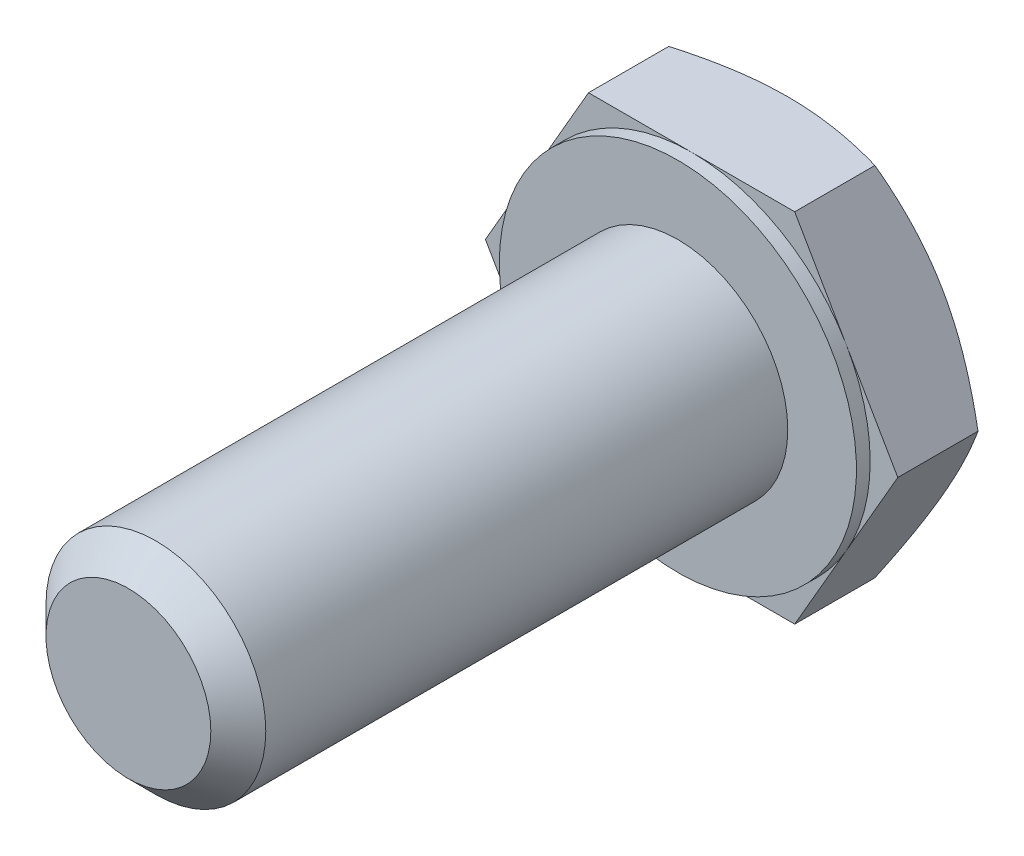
ISO-10303-21;
HEADER;
FILE_DESCRIPTION(('STEP AP214'),'2;1');
FILE_NAME('part.step','',(''),(''),'','','');
FILE_SCHEMA(('AUTOMOTIVE_DESIGN { 1 0 10303 214 1 1 1 1 }'));
ENDSEC;
DATA;
#1=APPLICATION_CONTEXT('core data for automotive mechanical design processes');
#2=APPLICATION_PROTOCOL_DEFINITION('international standard','automotive_design',2000,#1);
#3=PRODUCT_CONTEXT('',#1,'mechanical');
#4=PRODUCT('Part','Part','',(#3));
#5=PRODUCT_RELATED_PRODUCT_CATEGORY('part','',(#4));
#6=PRODUCT_DEFINITION_FORMATION('','',#4);
#7=PRODUCT_DEFINITION_CONTEXT('part definition',#1,'design');
#8=PRODUCT_DEFINITION('design','',#6,#7);
#9=PRODUCT_DEFINITION_SHAPE('','',#8);
#10=(LENGTH_UNIT() NAMED_UNIT(*) SI_UNIT(.MILLI.,.METRE.));
#11=(NAMED_UNIT(*) PLANE_ANGLE_UNIT() SI_UNIT($,.RADIAN.));
#12=(NAMED_UNIT(*) SI_UNIT($,.STERADIAN.) SOLID_ANGLE_UNIT());
#13=UNCERTAINTY_MEASURE_WITH_UNIT(LENGTH_MEASURE(1.E-05),#10,'distance_accuracy_value','');
#14=(GEOMETRIC_REPRESENTATION_CONTEXT(3) GLOBAL_UNCERTAINTY_ASSIGNED_CONTEXT((#13)) GLOBAL_UNIT_ASSIGNED_CONTEXT((#10,
#11,#12)) REPRESENTATION_CONTEXT('',''));
#15=CARTESIAN_POINT('',(0.,0.,0.));
#16=DIRECTION('',(0.,0.,1.));
#17=DIRECTION('',(1.,0.,0.));
#18=AXIS2_PLACEMENT_3D('',#15,#16,#17);
#19=CARTESIAN_POINT('',(0.,0.,-4.));
#20=DIRECTION('',(0.,0.,-1.));
#21=DIRECTION('',(-1.,0.,0.));
#22=AXIS2_PLACEMENT_3D('',#19,#20,#21);
#23=PLANE('',#22);
#24=CARTESIAN_POINT('',(0.,0.,-4.00000000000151));
#25=DIRECTION('',(0.,0.,1.));
#26=DIRECTION('',(0.,-1.,0.));
#27=AXIS2_PLACEMENT_3D('',#24,#25,#26);
#28=CIRCLE('',#27,6.49999999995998);
#29=CARTESIAN_POINT('',(-5.6291651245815,3.24999999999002,-3.99999999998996));
#30=VERTEX_POINT('',#29);
#31=CARTESIAN_POINT('',(-5.62916512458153,-3.24999999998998,-3.99999999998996));
#32=VERTEX_POINT('',#31);
#33=EDGE_CURVE('E94',#30,#32,#28,.T.);
#34=ORIENTED_EDGE('',*,*,#33,.F.);
#35=CARTESIAN_POINT('',(0.,0.,-4.00000000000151));
#36=DIRECTION('',(0.,0.,1.));
#37=DIRECTION('',(0.,-1.,0.));
#38=AXIS2_PLACEMENT_3D('',#35,#36,#37);
#39=CIRCLE('',#38,6.49999999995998);
#40=CARTESIAN_POINT('',(0.,6.49999999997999,-3.99999999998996));
#41=VERTEX_POINT('',#40);
#42=EDGE_CURVE('E127',#41,#30,#39,.T.);
#43=ORIENTED_EDGE('',*,*,#42,.F.);
#44=CARTESIAN_POINT('',(0.,0.,-4.00000000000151));
#45=DIRECTION('',(0.,0.,1.));
#46=DIRECTION('',(0.,-1.,0.));
#47=AXIS2_PLACEMENT_3D('',#44,#45,#46);
#48=CIRCLE('',#47,6.49999999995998);
#49=CARTESIAN_POINT('',(5.62916512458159,3.24999999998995,-3.99999999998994));
#50=VERTEX_POINT('',#49);
#51=EDGE_CURVE('E111',#50,#41,#48,.T.);
#52=ORIENTED_EDGE('',*,*,#51,.F.);
#53=CARTESIAN_POINT('',(0.,0.,-4.00000000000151));
#54=DIRECTION('',(0.,0.,1.));
#55=DIRECTION('',(0.,-1.,0.));
#56=AXIS2_PLACEMENT_3D('',#53,#54,#55);
#57=CIRCLE('',#56,6.49999999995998);
#58=CARTESIAN_POINT('',(5.62916512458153,-3.24999999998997,-3.99999999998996));
#59=VERTEX_POINT('',#58);
#60=EDGE_CURVE('E112',#59,#50,#57,.T.);
#61=ORIENTED_EDGE('',*,*,#60,.F.);
#62=CARTESIAN_POINT('',(0.,0.,-4.00000000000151));
#63=DIRECTION('',(0.,0.,1.));
#64=DIRECTION('',(0.,-1.,0.));
#65=AXIS2_PLACEMENT_3D('',#62,#63,#64);
#66=CIRCLE('',#65,6.49999999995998);
#67=CARTESIAN_POINT('',(0.,-6.49999999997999,-3.99999999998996));
#68=VERTEX_POINT('',#67);
#69=EDGE_CURVE('E97',#68,#59,#66,.T.);
#70=ORIENTED_EDGE('',*,*,#69,.F.);
#71=CARTESIAN_POINT('',(0.,0.,-4.00000000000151));
#72=DIRECTION('',(0.,0.,1.));
#73=DIRECTION('',(0.,-1.,0.));
#74=AXIS2_PLACEMENT_3D('',#71,#72,#73);
#75=CIRCLE('',#74,6.49999999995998);
#76=EDGE_CURVE('E19',#32,#68,#75,.T.);
#77=ORIENTED_EDGE('',*,*,#76,.F.);
#78=EDGE_LOOP('',(#34,#43,#52,#61,#70,#77));
#79=FACE_BOUND('',#78,.T.);
#80=ADVANCED_FACE('F16',(#79),#23,.T.);
#81=CARTESIAN_POINT('',(0.,0.,-3.41596007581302));
#82=DIRECTION('',(0.,0.,1.));
#83=DIRECTION('',(0.,-1.,0.));
#84=AXIS2_PLACEMENT_3D('',#81,#82,#83);
#85=CONICAL_SURFACE('',#84,7.51158681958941,1.04719755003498);
#86=CARTESIAN_POINT('',(-5.62916512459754,-3.24999999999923,-3.99999999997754));
#87=CARTESIAN_POINT('',(-5.54952296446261,-3.3879442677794,-4.000026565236));
#88=CARTESIAN_POINT('',(-5.46988464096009,-3.52588189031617,-3.99662027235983));
#89=CARTESIAN_POINT('',(-5.31076436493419,-3.80148629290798,-3.98313941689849));
#90=CARTESIAN_POINT('',(-5.23128238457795,-3.93915312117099,-3.97306617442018));
#91=CARTESIAN_POINT('',(-5.07298818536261,-4.21332671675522,-3.94651519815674));
#92=CARTESIAN_POINT('',(-4.99417460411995,-4.34983584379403,-3.93006970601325));
#93=CARTESIAN_POINT('',(-4.83692293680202,-4.62220372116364,-3.89112797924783));
#94=CARTESIAN_POINT('',(-4.75848486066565,-4.75806245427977,-3.86863158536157));
#95=CARTESIAN_POINT('',(-4.52405902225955,-5.16409991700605,-3.79276102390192));
#96=CARTESIAN_POINT('',(-4.36875227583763,-5.43309909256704,-3.73096863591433));
#97=CARTESIAN_POINT('',(-4.05947435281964,-5.9687841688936,-3.58845958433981));
#98=CARTESIAN_POINT('',(-3.90551396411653,-6.23545138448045,-3.50764840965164));
#99=CARTESIAN_POINT('',(-3.75277674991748,-6.49999999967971,-3.41944341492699));
#100=B_SPLINE_CURVE_WITH_KNOTS('',3,(#86,#87,#88,#89,#90,#91,#92,#93,#94,#95,#96,#97,#98,#99),
.UNSPECIFIED.,.F.,.F.,(4,2,2,2,2,2,4),(0.,0.477804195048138,0.955513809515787,1.43083727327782,
1.90617324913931,2.85559935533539,3.80984701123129),.UNSPECIFIED.);
#101=CARTESIAN_POINT('',(-3.75277674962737,-6.49999999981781,-3.41944341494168));
#102=VERTEX_POINT('',#101);
#103=EDGE_CURVE('E114',#32,#102,#100,.T.);
#104=ORIENTED_EDGE('',*,*,#103,.F.);
#105=ORIENTED_EDGE('',*,*,#76,.T.);
#106=CARTESIAN_POINT('',(-3.75277674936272,-6.50000000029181,-3.41944341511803));
#107=CARTESIAN_POINT('',(-3.44730232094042,-6.50000000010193,-3.50764840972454));
#108=CARTESIAN_POINT('',(-3.13938154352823,-6.50000000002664,-3.58845958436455));
#109=CARTESIAN_POINT('',(-2.52082569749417,-6.49999999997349,-3.73096863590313));
#110=CARTESIAN_POINT('',(-2.2102122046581,-6.49999999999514,-3.79276102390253));
#111=CARTESIAN_POINT('',(-1.74136052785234,-6.50000000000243,-3.86863158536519));
#112=CARTESIAN_POINT('',(-1.58448437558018,-6.50000000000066,-3.89112797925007));
#113=CARTESIAN_POINT('',(-1.26998104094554,-6.49999999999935,-3.93006970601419));
#114=CARTESIAN_POINT('',(-1.11235387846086,-6.49999999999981,-3.94651519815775));
#115=CARTESIAN_POINT('',(-0.795765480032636,-6.50000000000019,-3.97306617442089));
#116=CARTESIAN_POINT('',(-0.636801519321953,-6.5000000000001,-3.98313941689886));
#117=CARTESIAN_POINT('',(-0.318560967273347,-6.49999999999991,-3.99662027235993));
#118=CARTESIAN_POINT('',(-0.159284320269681,-6.49999999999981,-4.00002656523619));
#119=CARTESIAN_POINT('',(-2.49784673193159E-13,-6.5,-3.99999999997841));
#120=B_SPLINE_CURVE_WITH_KNOTS('',3,(#106,#107,#108,#109,#110,#111,#112,#113,#114,#115,#116,
#117,#118,#119),.UNSPECIFIED.,.F.,.F.,(4,2,2,2,2,2,4),(0.,0.954247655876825,1.90367376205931,
2.37900973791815,2.85433320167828,3.33204281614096,3.80984701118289),.UNSPECIFIED.);
#121=EDGE_CURVE('E117',#102,#68,#120,.T.);
#122=ORIENTED_EDGE('',*,*,#121,.F.);
#123=EDGE_LOOP('',(#104,#105,#122));
#124=FACE_BOUND('',#123,.T.);
#125=ADVANCED_FACE('F115',(#124),#85,.T.);
#126=CARTESIAN_POINT('',(0.,0.,-3.41596007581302));
#127=DIRECTION('',(0.,0.,1.));
#128=DIRECTION('',(0.,-1.,0.));
#129=AXIS2_PLACEMENT_3D('',#126,#127,#128);
#130=CONICAL_SURFACE('',#129,7.51158681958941,1.04719755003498);
#131=CARTESIAN_POINT('',(0.,-6.4999999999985,-3.99999999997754));
#132=CARTESIAN_POINT('',(0.159284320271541,-6.49999999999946,-4.000026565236));
#133=CARTESIAN_POINT('',(0.318560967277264,-6.49999999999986,-3.99662027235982));
#134=CARTESIAN_POINT('',(0.636801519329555,-6.50000000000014,-3.98313941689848));
#135=CARTESIAN_POINT('',(0.795765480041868,-6.50000000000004,-3.97306617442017));
#136=CARTESIAN_POINT('',(1.1123538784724,-6.49999999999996,-3.94651519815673));
#137=CARTESIAN_POINT('',(1.26998104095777,-6.49999999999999,-3.93006970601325));
#138=CARTESIAN_POINT('',(1.58448437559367,-6.50000000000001,-3.89112797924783));
#139=CARTESIAN_POINT('',(1.74136052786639,-6.5,-3.86863158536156));
#140=CARTESIAN_POINT('',(2.21021220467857,-6.49999999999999,-3.79276102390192));
#141=CARTESIAN_POINT('',(2.52082569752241,-6.5,-3.73096863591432));
#142=CARTESIAN_POINT('',(3.1393815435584,-6.5,-3.58845958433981));
#143=CARTESIAN_POINT('',(3.44730232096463,-6.50000000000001,-3.50764840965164));
#144=CARTESIAN_POINT('',(3.75277674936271,-6.5,-3.41944341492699));
#145=B_SPLINE_CURVE_WITH_KNOTS('',3,(#131,#132,#133,#134,#135,#136,#137,#138,#139,#140,#141,
#142,#143,#144),.UNSPECIFIED.,.F.,.F.,(4,2,2,2,2,2,4),(0.,0.477804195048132,0.955513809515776,
1.4308372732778,1.90617324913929,2.85559935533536,3.80984701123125),.UNSPECIFIED.);
#146=CARTESIAN_POINT('',(3.75277674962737,-6.49999999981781,-3.41944341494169));
#147=VERTEX_POINT('',#146);
#148=EDGE_CURVE('E212',#68,#147,#145,.T.);
#149=ORIENTED_EDGE('',*,*,#148,.F.);
#150=ORIENTED_EDGE('',*,*,#69,.T.);
#151=CARTESIAN_POINT('',(3.7527767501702,-6.49999999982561,-3.41944341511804));
#152=CARTESIAN_POINT('',(3.90551396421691,-6.23545138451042,-3.50764840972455));
#153=CARTESIAN_POINT('',(4.0594743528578,-5.96878416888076,-3.58845958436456));
#154=CARTESIAN_POINT('',(4.36875227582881,-5.43309909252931,-3.73096863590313));
#155=CARTESIAN_POINT('',(4.52405902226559,-5.16409991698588,-3.79276102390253));
#156=CARTESIAN_POINT('',(4.75848486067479,-4.7580624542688,-3.8686315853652));
#157=CARTESIAN_POINT('',(4.83692293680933,-4.62220372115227,-3.89112797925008));
#158=CARTESIAN_POINT('',(4.99417460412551,-4.3498358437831,-3.9300697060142));
#159=CARTESIAN_POINT('',(5.07298818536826,-4.21332671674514,-3.94651519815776));
#160=CARTESIAN_POINT('',(5.2312823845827,-3.93915312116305,-3.9730661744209));
#161=CARTESIAN_POINT('',(5.31076436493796,-3.80148629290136,-3.98313941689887));
#162=CARTESIAN_POINT('',(5.4698846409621,-3.52588189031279,-3.99662027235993));
#163=CARTESIAN_POINT('',(5.54952296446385,-3.38794426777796,-4.00002656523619));
#164=CARTESIAN_POINT('',(5.62916512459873,-3.25000000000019,-3.99999999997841));
#165=B_SPLINE_CURVE_WITH_KNOTS('',3,(#151,#152,#153,#154,#155,#156,#157,#158,#159,#160,#161,
#162,#163,#164),.UNSPECIFIED.,.F.,.F.,(4,2,2,2,2,2,4),(0.,0.95424765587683,1.90367376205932,
2.37900973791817,2.8543332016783,3.33204281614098,3.80984701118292),.UNSPECIFIED.);
#166=EDGE_CURVE('E205',#147,#59,#165,.T.);
#167=ORIENTED_EDGE('',*,*,#166,.F.);
#168=EDGE_LOOP('',(#149,#150,#167));
#169=FACE_BOUND('',#168,.T.);
#170=ADVANCED_FACE('F216',(#169),#130,.T.);
#171=CARTESIAN_POINT('',(0.,0.,-3.41596007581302));
#172=DIRECTION('',(0.,0.,1.));
#173=DIRECTION('',(0.,-1.,0.));
#174=AXIS2_PLACEMENT_3D('',#171,#172,#173);
#175=CONICAL_SURFACE('',#174,7.51158681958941,1.04719755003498);
#176=ORIENTED_EDGE('',*,*,#60,.T.);
#177=CARTESIAN_POINT('',(7.50555349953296,4.66246568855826E-10,-3.41944341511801));
#178=CARTESIAN_POINT('',(7.35281628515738,0.264548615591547,-3.50764840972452));
#179=CARTESIAN_POINT('',(7.19885589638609,0.531215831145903,-3.58845958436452));
#180=CARTESIAN_POINT('',(6.88957797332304,1.0669009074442,-3.73096863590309));
#181=CARTESIAN_POINT('',(6.73427122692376,1.33590008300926,-3.79276102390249));
#182=CARTESIAN_POINT('',(6.4998453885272,1.74193754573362,-3.86863158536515));
#183=CARTESIAN_POINT('',(6.42140731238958,1.87779627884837,-3.89112797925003));
#184=CARTESIAN_POINT('',(6.26415564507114,2.15016415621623,-3.93006970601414));
#185=CARTESIAN_POINT('',(6.1853420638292,2.28667328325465,-3.94651519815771));
#186=CARTESIAN_POINT('',(6.02704786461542,2.5608468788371,-3.97306617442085));
#187=CARTESIAN_POINT('',(5.94756588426,2.6985137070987,-3.98313941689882));
#188=CARTESIAN_POINT('',(5.78844560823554,2.97411810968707,-3.99662027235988));
#189=CARTESIAN_POINT('',(5.70880728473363,3.1120557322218,-4.00002656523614));
#190=CARTESIAN_POINT('',(5.62916512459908,3.24999999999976,-3.99999999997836));
#191=B_SPLINE_CURVE_WITH_KNOTS('',3,(#177,#178,#179,#180,#181,#182,#183,#184,#185,#186,#187,
#188,#189,#190),.UNSPECIFIED.,.F.,.F.,(4,2,2,2,2,2,4),(0.,0.954247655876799,1.90367376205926,
2.37900973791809,2.85433320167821,3.33204281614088,3.8098470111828),.UNSPECIFIED.);
#192=CARTESIAN_POINT('',(7.50555349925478,0.,-3.41944341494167));
#193=VERTEX_POINT('',#192);
#194=EDGE_CURVE('E193',#193,#50,#191,.T.);
#195=ORIENTED_EDGE('',*,*,#194,.F.);
#196=CARTESIAN_POINT('',(5.62916512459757,-3.24999999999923,-3.99999999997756));
#197=CARTESIAN_POINT('',(5.70880728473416,-3.11205573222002,-4.00002656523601));
#198=CARTESIAN_POINT('',(5.78844560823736,-2.97411810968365,-3.99662027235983));
#199=CARTESIAN_POINT('',(5.94756588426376,-2.69851370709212,-3.98313941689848));
#200=CARTESIAN_POINT('',(6.02704786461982,-2.56084687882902,-3.97306617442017));
#201=CARTESIAN_POINT('',(6.18534206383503,-2.2866732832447,-3.94651519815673));
#202=CARTESIAN_POINT('',(6.26415564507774,-2.15016415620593,-3.93006970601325));
#203=CARTESIAN_POINT('',(6.4214073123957,-1.87779627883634,-3.89112797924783));
#204=CARTESIAN_POINT('',(6.49984538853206,-1.7419375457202,-3.86863158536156));
#205=CARTESIAN_POINT('',(6.73427122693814,-1.33590008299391,-3.79276102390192));
#206=CARTESIAN_POINT('',(6.88957797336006,-1.06690090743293,-3.73096863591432));
#207=CARTESIAN_POINT('',(7.19885589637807,-0.531215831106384,-3.5884595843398));
#208=CARTESIAN_POINT('',(7.35281628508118,-0.264548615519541,-3.50764840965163));
#209=CARTESIAN_POINT('',(7.50555349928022,-3.20270050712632E-10,-3.41944341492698));
#210=B_SPLINE_CURVE_WITH_KNOTS('',3,(#196,#197,#198,#199,#200,#201,#202,#203,#204,#205,#206,
#207,#208,#209),.UNSPECIFIED.,.F.,.F.,(4,2,2,2,2,2,4),(0.,0.477804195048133,0.95551380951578,
1.43083727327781,1.9061732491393,2.85559935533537,3.80984701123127),.UNSPECIFIED.);
#211=EDGE_CURVE('E200',#59,#193,#210,.T.);
#212=ORIENTED_EDGE('',*,*,#211,.F.);
#213=EDGE_LOOP('',(#176,#195,#212));
#214=FACE_BOUND('',#213,.T.);
#215=ADVANCED_FACE('F148',(#214),#175,.T.);
#216=CARTESIAN_POINT('',(0.,0.,-3.41596007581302));
#217=DIRECTION('',(0.,0.,1.));
#218=DIRECTION('',(0.,-1.,0.));
#219=AXIS2_PLACEMENT_3D('',#216,#217,#218);
#220=CONICAL_SURFACE('',#219,7.51158681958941,1.04719755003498);
#221=CARTESIAN_POINT('',(-5.62916512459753,3.24999999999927,-3.99999999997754));
#222=CARTESIAN_POINT('',(-5.70880728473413,3.11205573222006,-4.000026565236));
#223=CARTESIAN_POINT('',(-5.78844560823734,2.9741181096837,-3.99662027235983));
#224=CARTESIAN_POINT('',(-5.94756588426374,2.69851370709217,-3.98313941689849));
#225=CARTESIAN_POINT('',(-6.0270478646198,2.56084687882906,-3.97306617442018));
#226=CARTESIAN_POINT('',(-6.18534206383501,2.28667328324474,-3.94651519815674));
#227=CARTESIAN_POINT('',(-6.26415564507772,2.15016415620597,-3.93006970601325));
#228=CARTESIAN_POINT('',(-6.42140731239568,1.87779627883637,-3.89112797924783));
#229=CARTESIAN_POINT('',(-6.49984538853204,1.74193754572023,-3.86863158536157));
#230=CARTESIAN_POINT('',(-6.73427122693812,1.33590008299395,-3.79276102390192));
#231=CARTESIAN_POINT('',(-6.88957797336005,1.06690090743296,-3.73096863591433));
#232=CARTESIAN_POINT('',(-7.19885589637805,0.531215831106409,-3.58845958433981));
#233=CARTESIAN_POINT('',(-7.35281628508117,0.264548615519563,-3.50764840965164));
#234=CARTESIAN_POINT('',(-7.5055534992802,3.20290128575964E-10,-3.41944341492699));
#235=B_SPLINE_CURVE_WITH_KNOTS('',3,(#221,#222,#223,#224,#225,#226,#227,#228,#229,#230,#231,
#232,#233,#234),.UNSPECIFIED.,.F.,.F.,(4,2,2,2,2,2,4),(0.,0.477804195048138,0.955513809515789,
1.43083727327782,1.90617324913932,2.8555993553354,3.8098470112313),.UNSPECIFIED.);
#236=CARTESIAN_POINT('',(-7.50555349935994,-1.82185933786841E-10,-3.41944341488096));
#237=VERTEX_POINT('',#236);
#238=EDGE_CURVE('E109',#30,#237,#235,.T.);
#239=ORIENTED_EDGE('',*,*,#238,.F.);
#240=ORIENTED_EDGE('',*,*,#33,.T.);
#241=CARTESIAN_POINT('',(-7.50555349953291,-4.66187237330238E-10,-3.41944341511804));
#242=CARTESIAN_POINT('',(-7.35281628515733,-0.264548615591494,-3.50764840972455));
#243=CARTESIAN_POINT('',(-7.19885589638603,-0.531215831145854,-3.58845958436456));
#244=CARTESIAN_POINT('',(-6.88957797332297,-1.06690090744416,-3.73096863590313));
#245=CARTESIAN_POINT('',(-6.73427122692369,-1.33590008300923,-3.79276102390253));
#246=CARTESIAN_POINT('',(-6.49984538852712,-1.7419375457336,-3.8686315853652));
#247=CARTESIAN_POINT('',(-6.4214073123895,-1.87779627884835,-3.89112797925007));
#248=CARTESIAN_POINT('',(-6.26415564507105,-2.15016415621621,-3.93006970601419));
#249=CARTESIAN_POINT('',(-6.18534206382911,-2.28667328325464,-3.94651519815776));
#250=CARTESIAN_POINT('',(-6.02704786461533,-2.56084687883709,-3.9730661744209));
#251=CARTESIAN_POINT('',(-5.94756588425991,-2.69851370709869,-3.98313941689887));
#252=CARTESIAN_POINT('',(-5.78844560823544,-2.97411810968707,-3.99662027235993));
#253=CARTESIAN_POINT('',(-5.70880728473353,-3.11205573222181,-4.00002656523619));
#254=CARTESIAN_POINT('',(-5.62916512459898,-3.24999999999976,-3.99999999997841));
#255=B_SPLINE_CURVE_WITH_KNOTS('',3,(#241,#242,#243,#244,#245,#246,#247,#248,#249,#250,#251,
#252,#253,#254),.UNSPECIFIED.,.F.,.F.,(4,2,2,2,2,2,4),(0.,0.954247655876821,1.90367376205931,
2.37900973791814,2.85433320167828,3.33204281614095,3.80984701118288),.UNSPECIFIED.);
#256=EDGE_CURVE('E106',#237,#32,#255,.T.);
#257=ORIENTED_EDGE('',*,*,#256,.F.);
#258=EDGE_LOOP('',(#239,#240,#257));
#259=FACE_BOUND('',#258,.T.);
#260=ADVANCED_FACE('F104',(#259),#220,.T.);
#261=CARTESIAN_POINT('',(0.,0.,-3.41596007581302));
#262=DIRECTION('',(0.,0.,1.));
#263=DIRECTION('',(0.,-1.,0.));
#264=AXIS2_PLACEMENT_3D('',#261,#262,#263);
#265=CONICAL_SURFACE('',#264,7.51158681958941,1.04719755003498);
#266=ORIENTED_EDGE('',*,*,#51,.T.);
#267=CARTESIAN_POINT('',(3.75277674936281,6.50000000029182,-3.41944341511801));
#268=CARTESIAN_POINT('',(3.4473023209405,6.50000000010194,-3.50764840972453));
#269=CARTESIAN_POINT('',(3.13938154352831,6.50000000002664,-3.58845958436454));
#270=CARTESIAN_POINT('',(2.52082569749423,6.49999999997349,-3.73096863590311));
#271=CARTESIAN_POINT('',(2.21021220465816,6.49999999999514,-3.79276102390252));
#272=CARTESIAN_POINT('',(1.74136052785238,6.50000000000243,-3.86863158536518));
#273=CARTESIAN_POINT('',(1.58448437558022,6.50000000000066,-3.89112797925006));
#274=CARTESIAN_POINT('',(1.26998104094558,6.49999999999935,-3.93006970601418));
#275=CARTESIAN_POINT('',(1.11235387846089,6.49999999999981,-3.94651519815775));
#276=CARTESIAN_POINT('',(0.795765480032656,6.50000000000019,-3.97306617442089));
#277=CARTESIAN_POINT('',(0.636801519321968,6.5000000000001,-3.98313941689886));
#278=CARTESIAN_POINT('',(0.318560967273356,6.49999999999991,-3.99662027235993));
#279=CARTESIAN_POINT('',(0.159284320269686,6.49999999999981,-4.00002656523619));
#280=CARTESIAN_POINT('',(2.49681546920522E-13,6.5,-3.99999999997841));
#281=B_SPLINE_CURVE_WITH_KNOTS('',3,(#267,#268,#269,#270,#271,#272,#273,#274,#275,#276,#277,
#278,#279,#280),.UNSPECIFIED.,.F.,.F.,(4,2,2,2,2,2,4),(0.,0.954247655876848,1.90367376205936,
2.37900973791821,2.85433320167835,3.33204281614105,3.80984701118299),.UNSPECIFIED.);
#282=CARTESIAN_POINT('',(3.75277674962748,6.4999999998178,-3.41944341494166));
#283=VERTEX_POINT('',#282);
#284=EDGE_CURVE('E161',#283,#41,#281,.T.);
#285=ORIENTED_EDGE('',*,*,#284,.F.);
#286=CARTESIAN_POINT('',(5.62916512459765,3.24999999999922,-3.99999999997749));
#287=CARTESIAN_POINT('',(5.54952296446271,3.3879442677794,-4.00002656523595));
#288=CARTESIAN_POINT('',(5.4698846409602,3.52588189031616,-3.99662027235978));
#289=CARTESIAN_POINT('',(5.3107643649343,3.80148629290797,-3.98313941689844));
#290=CARTESIAN_POINT('',(5.23128238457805,3.93915312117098,-3.97306617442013));
#291=CARTESIAN_POINT('',(5.07298818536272,4.21332671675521,-3.94651519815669));
#292=CARTESIAN_POINT('',(4.99417460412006,4.34983584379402,-3.93006970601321));
#293=CARTESIAN_POINT('',(4.83692293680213,4.62220372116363,-3.89112797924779));
#294=CARTESIAN_POINT('',(4.75848486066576,4.75806245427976,-3.86863158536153));
#295=CARTESIAN_POINT('',(4.52405902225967,5.16409991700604,-3.79276102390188));
#296=CARTESIAN_POINT('',(4.36875227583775,5.43309909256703,-3.73096863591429));
#297=CARTESIAN_POINT('',(4.05947435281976,5.96878416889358,-3.58845958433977));
#298=CARTESIAN_POINT('',(3.90551396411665,6.23545138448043,-3.50764840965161));
#299=CARTESIAN_POINT('',(3.75277674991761,6.49999999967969,-3.41944341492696));
#300=B_SPLINE_CURVE_WITH_KNOTS('',3,(#286,#287,#288,#289,#290,#291,#292,#293,#294,#295,#296,
#297,#298,#299),.UNSPECIFIED.,.F.,.F.,(4,2,2,2,2,2,4),(0.,0.477804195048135,0.955513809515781,
1.43083727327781,1.9061732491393,2.85559935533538,3.80984701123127),.UNSPECIFIED.);
#301=EDGE_CURVE('E188',#50,#283,#300,.T.);
#302=ORIENTED_EDGE('',*,*,#301,.F.);
#303=EDGE_LOOP('',(#266,#285,#302));
#304=FACE_BOUND('',#303,.T.);
#305=ADVANCED_FACE('F147',(#304),#265,.T.);
#306=CARTESIAN_POINT('',(0.,0.,-3.41596007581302));
#307=DIRECTION('',(0.,0.,1.));
#308=DIRECTION('',(0.,-1.,0.));
#309=AXIS2_PLACEMENT_3D('',#306,#307,#308);
#310=CONICAL_SURFACE('',#309,7.51158681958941,1.04719755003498);
#311=CARTESIAN_POINT('',(0.,6.4999999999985,-3.99999999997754));
#312=CARTESIAN_POINT('',(-0.159284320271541,6.49999999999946,-4.000026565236));
#313=CARTESIAN_POINT('',(-0.318560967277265,6.49999999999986,-3.99662027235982));
#314=CARTESIAN_POINT('',(-0.636801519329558,6.50000000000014,-3.98313941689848));
#315=CARTESIAN_POINT('',(-0.795765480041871,6.50000000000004,-3.97306617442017));
#316=CARTESIAN_POINT('',(-1.11235387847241,6.49999999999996,-3.94651519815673));
#317=CARTESIAN_POINT('',(-1.26998104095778,6.49999999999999,-3.93006970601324));
#318=CARTESIAN_POINT('',(-1.58448437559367,6.50000000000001,-3.89112797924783));
#319=CARTESIAN_POINT('',(-1.7413605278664,6.5,-3.86863158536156));
#320=CARTESIAN_POINT('',(-2.21021220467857,6.49999999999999,-3.79276102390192));
#321=CARTESIAN_POINT('',(-2.52082569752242,6.5,-3.73096863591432));
#322=CARTESIAN_POINT('',(-3.13938154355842,6.5,-3.5884595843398));
#323=CARTESIAN_POINT('',(-3.44730232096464,6.50000000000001,-3.50764840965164));
#324=CARTESIAN_POINT('',(-3.75277674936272,6.5,-3.41944341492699));
#325=B_SPLINE_CURVE_WITH_KNOTS('',3,(#311,#312,#313,#314,#315,#316,#317,#318,#319,#320,#321,
#322,#323,#324),.UNSPECIFIED.,.F.,.F.,(4,2,2,2,2,2,4),(0.,0.477804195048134,0.95551380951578,
1.43083727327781,1.9061732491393,2.85559935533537,3.80984701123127),.UNSPECIFIED.);
#326=CARTESIAN_POINT('',(-3.75277674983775,6.49999999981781,-3.41944341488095));
#327=VERTEX_POINT('',#326);
#328=EDGE_CURVE('E313',#41,#327,#325,.T.);
#329=ORIENTED_EDGE('',*,*,#328,.F.);
#330=ORIENTED_EDGE('',*,*,#42,.T.);
#331=CARTESIAN_POINT('',(-3.75277675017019,6.49999999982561,-3.41944341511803));
#332=CARTESIAN_POINT('',(-3.90551396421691,6.23545138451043,-3.50764840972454));
#333=CARTESIAN_POINT('',(-4.0594743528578,5.96878416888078,-3.58845958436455));
#334=CARTESIAN_POINT('',(-4.3687522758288,5.43309909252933,-3.73096863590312));
#335=CARTESIAN_POINT('',(-4.52405902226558,5.16409991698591,-3.79276102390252));
#336=CARTESIAN_POINT('',(-4.75848486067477,4.75806245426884,-3.86863158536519));
#337=CARTESIAN_POINT('',(-4.83692293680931,4.62220372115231,-3.89112797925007));
#338=CARTESIAN_POINT('',(-4.99417460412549,4.34983584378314,-3.93006970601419));
#339=CARTESIAN_POINT('',(-5.07298818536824,4.21332671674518,-3.94651519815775));
#340=CARTESIAN_POINT('',(-5.23128238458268,3.9391531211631,-3.97306617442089));
#341=CARTESIAN_POINT('',(-5.31076436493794,3.80148629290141,-3.98313941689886));
#342=CARTESIAN_POINT('',(-5.46988464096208,3.52588189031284,-3.99662027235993));
#343=CARTESIAN_POINT('',(-5.54952296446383,3.38794426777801,-4.00002656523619));
#344=CARTESIAN_POINT('',(-5.62916512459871,3.25000000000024,-3.99999999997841));
#345=B_SPLINE_CURVE_WITH_KNOTS('',3,(#331,#332,#333,#334,#335,#336,#337,#338,#339,#340,#341,
#342,#343,#344),.UNSPECIFIED.,.F.,.F.,(4,2,2,2,2,2,4),(0.,0.954247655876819,1.9036737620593,
2.37900973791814,2.85433320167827,3.33204281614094,3.80984701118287),.UNSPECIFIED.);
#346=EDGE_CURVE('E160',#327,#30,#345,.T.);
#347=ORIENTED_EDGE('',*,*,#346,.F.);
#348=EDGE_LOOP('',(#329,#330,#347));
#349=FACE_BOUND('',#348,.T.);
#350=ADVANCED_FACE('F238',(#349),#310,.T.);
#351=CARTESIAN_POINT('',(-3.75277674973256,-6.5,-4.));
#352=DIRECTION('',(-0.866025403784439,-0.499999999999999,0.));
#353=DIRECTION('',(0.499999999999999,-0.866025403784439,0.));
#354=AXIS2_PLACEMENT_3D('',#351,#352,#353);
#355=PLANE('',#354);
#356=DIRECTION('',(0.,0.,-1.));
#357=VECTOR('',#356,1.);
#358=CARTESIAN_POINT('',(-3.75277674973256,-6.5,-4.));
#359=LINE('',#358,#357);
#360=CARTESIAN_POINT('',(-3.75277674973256,-6.5,-0.5));
#361=VERTEX_POINT('',#360);
#362=EDGE_CURVE('E121',#361,#102,#359,.T.);
#363=ORIENTED_EDGE('',*,*,#362,.F.);
#364=DIRECTION('',(-0.500000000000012,0.866025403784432,0.));
#365=VECTOR('',#364,1.);
#366=CARTESIAN_POINT('',(-3.75277674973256,-6.5,-0.5));
#367=LINE('',#366,#365);
#368=CARTESIAN_POINT('',(-5.62916512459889,-3.25000000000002,-0.5));
#369=VERTEX_POINT('',#368);
#370=EDGE_CURVE('E305',#361,#369,#367,.T.);
#371=ORIENTED_EDGE('',*,*,#370,.T.);
#372=DIRECTION('',(-0.499999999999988,0.866025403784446,0.));
#373=VECTOR('',#372,1.);
#374=CARTESIAN_POINT('',(-5.6291651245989,-3.25,-0.5));
#375=LINE('',#374,#373);
#376=CARTESIAN_POINT('',(-7.50555349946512,0.,-0.499999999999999));
#377=VERTEX_POINT('',#376);
#378=EDGE_CURVE('E294',#369,#377,#375,.T.);
#379=ORIENTED_EDGE('',*,*,#378,.T.);
#380=DIRECTION('',(0.,0.,1.));
#381=VECTOR('',#380,1.);
#382=CARTESIAN_POINT('',(-7.50555349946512,0.,-4.));
#383=LINE('',#382,#381);
#384=EDGE_CURVE('E126',#237,#377,#383,.T.);
#385=ORIENTED_EDGE('',*,*,#384,.F.);
#386=ORIENTED_EDGE('',*,*,#256,.T.);
#387=ORIENTED_EDGE('',*,*,#103,.T.);
#388=EDGE_LOOP('',(#363,#371,#379,#385,#386,#387));
#389=FACE_BOUND('',#388,.T.);
#390=ADVANCED_FACE('F123',(#389),#355,.T.);
#391=CARTESIAN_POINT('',(3.75277674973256,-6.5,-4.));
#392=DIRECTION('',(0.,-1.,0.));
#393=DIRECTION('',(0.,0.,-1.));
#394=AXIS2_PLACEMENT_3D('',#391,#392,#393);
#395=PLANE('',#394);
#396=DIRECTION('',(0.,0.,1.));
#397=VECTOR('',#396,1.);
#398=CARTESIAN_POINT('',(3.75277674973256,-6.5,-4.));
#399=LINE('',#398,#397);
#400=CARTESIAN_POINT('',(3.75277674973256,-6.5,-0.499999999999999));
#401=VERTEX_POINT('',#400);
#402=EDGE_CURVE('E211',#401,#147,#399,.F.);
#403=ORIENTED_EDGE('',*,*,#402,.F.);
#404=DIRECTION('',(-1.,0.,0.));
#405=VECTOR('',#404,1.);
#406=CARTESIAN_POINT('',(0.,-6.5,-0.5));
#407=LINE('',#406,#405);
#408=CARTESIAN_POINT('',(0.,-6.5,-0.5));
#409=VERTEX_POINT('',#408);
#410=EDGE_CURVE('E377',#401,#409,#407,.T.);
#411=ORIENTED_EDGE('',*,*,#410,.T.);
#412=DIRECTION('',(-1.,0.,0.));
#413=VECTOR('',#412,1.);
#414=CARTESIAN_POINT('',(0.,-6.5,-0.5));
#415=LINE('',#414,#413);
#416=EDGE_CURVE('E302',#409,#361,#415,.T.);
#417=ORIENTED_EDGE('',*,*,#416,.T.);
#418=ORIENTED_EDGE('',*,*,#362,.T.);
#419=ORIENTED_EDGE('',*,*,#121,.T.);
#420=ORIENTED_EDGE('',*,*,#148,.T.);
#421=EDGE_LOOP('',(#403,#411,#417,#418,#419,#420));
#422=FACE_BOUND('',#421,.T.);
#423=ADVANCED_FACE('F227',(#422),#395,.T.);
#424=CARTESIAN_POINT('',(7.50555349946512,0.,-4.));
#425=DIRECTION('',(0.866025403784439,-0.5,0.));
#426=DIRECTION('',(0.5,0.866025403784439,0.));
#427=AXIS2_PLACEMENT_3D('',#424,#425,#426);
#428=PLANE('',#427);
#429=DIRECTION('',(0.,0.,1.));
#430=VECTOR('',#429,1.);
#431=CARTESIAN_POINT('',(7.50555349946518,0.,-4.));
#432=LINE('',#431,#430);
#433=CARTESIAN_POINT('',(7.50555349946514,0.,-0.5));
#434=VERTEX_POINT('',#433);
#435=EDGE_CURVE('E199',#434,#193,#432,.F.);
#436=ORIENTED_EDGE('',*,*,#435,.F.);
#437=DIRECTION('',(-0.499999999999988,-0.866025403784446,0.));
#438=VECTOR('',#437,1.);
#439=CARTESIAN_POINT('',(7.50555349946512,0.,-0.5));
#440=LINE('',#439,#438);
#441=CARTESIAN_POINT('',(5.62916512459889,-3.25000000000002,-0.5));
#442=VERTEX_POINT('',#441);
#443=EDGE_CURVE('E398',#434,#442,#440,.T.);
#444=ORIENTED_EDGE('',*,*,#443,.T.);
#445=DIRECTION('',(-0.500000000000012,-0.866025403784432,0.));
#446=VECTOR('',#445,1.);
#447=CARTESIAN_POINT('',(5.6291651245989,-3.25,-0.5));
#448=LINE('',#447,#446);
#449=EDGE_CURVE('E375',#442,#401,#448,.T.);
#450=ORIENTED_EDGE('',*,*,#449,.T.);
#451=ORIENTED_EDGE('',*,*,#402,.T.);
#452=ORIENTED_EDGE('',*,*,#166,.T.);
#453=ORIENTED_EDGE('',*,*,#211,.T.);
#454=EDGE_LOOP('',(#436,#444,#450,#451,#452,#453));
#455=FACE_BOUND('',#454,.T.);
#456=ADVANCED_FACE('F184',(#455),#428,.T.);
#457=CARTESIAN_POINT('',(3.75277674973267,6.5,-4.));
#458=DIRECTION('',(0.866025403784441,0.499999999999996,0.));
#459=DIRECTION('',(-0.499999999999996,0.866025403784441,0.));
#460=AXIS2_PLACEMENT_3D('',#457,#458,#459);
#461=PLANE('',#460);
#462=DIRECTION('',(0.,0.,1.));
#463=VECTOR('',#462,1.);
#464=CARTESIAN_POINT('',(3.75277674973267,6.5,-4.));
#465=LINE('',#464,#463);
#466=CARTESIAN_POINT('',(3.75277674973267,6.5,-0.5));
#467=VERTEX_POINT('',#466);
#468=EDGE_CURVE('E314',#467,#283,#465,.F.);
#469=ORIENTED_EDGE('',*,*,#468,.F.);
#470=DIRECTION('',(0.499999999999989,-0.866025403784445,0.));
#471=VECTOR('',#470,1.);
#472=CARTESIAN_POINT('',(3.75277674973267,6.5,-0.5));
#473=LINE('',#472,#471);
#474=CARTESIAN_POINT('',(5.6291651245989,3.24999999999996,-0.5));
#475=VERTEX_POINT('',#474);
#476=EDGE_CURVE('E391',#467,#475,#473,.T.);
#477=ORIENTED_EDGE('',*,*,#476,.T.);
#478=DIRECTION('',(0.499999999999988,-0.866025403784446,0.));
#479=VECTOR('',#478,1.);
#480=CARTESIAN_POINT('',(5.6291651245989,3.25,-0.5));
#481=LINE('',#480,#479);
#482=EDGE_CURVE('E406',#475,#434,#481,.T.);
#483=ORIENTED_EDGE('',*,*,#482,.T.);
#484=ORIENTED_EDGE('',*,*,#435,.T.);
#485=ORIENTED_EDGE('',*,*,#194,.T.);
#486=ORIENTED_EDGE('',*,*,#301,.T.);
#487=EDGE_LOOP('',(#469,#477,#483,#484,#485,#486));
#488=FACE_BOUND('',#487,.T.);
#489=ADVANCED_FACE('F176',(#488),#461,.T.);
#490=CARTESIAN_POINT('',(-7.50555349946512,0.,-4.));
#491=DIRECTION('',(-0.866025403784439,0.499999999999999,0.));
#492=DIRECTION('',(-0.499999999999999,-0.866025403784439,0.));
#493=AXIS2_PLACEMENT_3D('',#490,#491,#492);
#494=PLANE('',#493);
#495=ORIENTED_EDGE('',*,*,#384,.T.);
#496=DIRECTION('',(0.500000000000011,0.866025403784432,0.));
#497=VECTOR('',#496,1.);
#498=CARTESIAN_POINT('',(-7.50555349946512,0.,-0.5));
#499=LINE('',#498,#497);
#500=CARTESIAN_POINT('',(-5.6291651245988,3.24999999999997,-0.5));
#501=VERTEX_POINT('',#500);
#502=EDGE_CURVE('E293',#377,#501,#499,.T.);
#503=ORIENTED_EDGE('',*,*,#502,.T.);
#504=DIRECTION('',(0.499999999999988,0.866025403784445,0.));
#505=VECTOR('',#504,1.);
#506=CARTESIAN_POINT('',(-5.62916512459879,3.25,-0.5));
#507=LINE('',#506,#505);
#508=CARTESIAN_POINT('',(-3.75277674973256,6.5,-0.5));
#509=VERTEX_POINT('',#508);
#510=EDGE_CURVE('E400',#501,#509,#507,.T.);
#511=ORIENTED_EDGE('',*,*,#510,.T.);
#512=DIRECTION('',(0.,0.,1.));
#513=VECTOR('',#512,1.);
#514=CARTESIAN_POINT('',(-3.75277674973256,6.5,-4.));
#515=LINE('',#514,#513);
#516=EDGE_CURVE('E307',#327,#509,#515,.T.);
#517=ORIENTED_EDGE('',*,*,#516,.F.);
#518=ORIENTED_EDGE('',*,*,#346,.T.);
#519=ORIENTED_EDGE('',*,*,#238,.T.);
#520=EDGE_LOOP('',(#495,#503,#511,#517,#518,#519));
#521=FACE_BOUND('',#520,.T.);
#522=ADVANCED_FACE('F171',(#521),#494,.T.);
#523=CARTESIAN_POINT('',(-3.75277674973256,6.5,-4.));
#524=DIRECTION('',(0.,1.,0.));
#525=DIRECTION('',(0.,0.,1.));
#526=AXIS2_PLACEMENT_3D('',#523,#524,#525);
#527=PLANE('',#526);
#528=ORIENTED_EDGE('',*,*,#516,.T.);
#529=DIRECTION('',(-1.,0.,0.));
#530=VECTOR('',#529,1.);
#531=CARTESIAN_POINT('',(0.,6.5,-0.5));
#532=LINE('',#531,#530);
#533=CARTESIAN_POINT('',(0.,6.5,-0.5));
#534=VERTEX_POINT('',#533);
#535=EDGE_CURVE('E344',#509,#534,#532,.F.);
#536=ORIENTED_EDGE('',*,*,#535,.T.);
#537=DIRECTION('',(-1.,0.,0.));
#538=VECTOR('',#537,1.);
#539=CARTESIAN_POINT('',(0.,6.5,-0.5));
#540=LINE('',#539,#538);
#541=EDGE_CURVE('E394',#534,#467,#540,.F.);
#542=ORIENTED_EDGE('',*,*,#541,.T.);
#543=ORIENTED_EDGE('',*,*,#468,.T.);
#544=ORIENTED_EDGE('',*,*,#284,.T.);
#545=ORIENTED_EDGE('',*,*,#328,.T.);
#546=EDGE_LOOP('',(#528,#536,#542,#543,#544,#545));
#547=FACE_BOUND('',#546,.T.);
#548=ADVANCED_FACE('F175',(#547),#527,.T.);
#549=CARTESIAN_POINT('',(0.,0.,-0.5));
#550=DIRECTION('',(0.,0.,-1.));
#551=DIRECTION('',(-1.,0.,0.));
#552=AXIS2_PLACEMENT_3D('',#549,#550,#551);
#553=PLANE('',#552);
#554=ORIENTED_EDGE('',*,*,#502,.F.);
#555=ORIENTED_EDGE('',*,*,#378,.F.);
#556=CARTESIAN_POINT('',(0.,0.,-0.5));
#557=DIRECTION('',(0.,0.,-1.));
#558=DIRECTION('',(-1.,0.,0.));
#559=AXIS2_PLACEMENT_3D('',#556,#557,#558);
#560=CIRCLE('',#559,6.5);
#561=EDGE_CURVE('E297',#501,#369,#560,.F.);
#562=ORIENTED_EDGE('',*,*,#561,.F.);
#563=EDGE_LOOP('',(#554,#555,#562));
#564=FACE_BOUND('',#563,.T.);
#565=ADVANCED_FACE('F282',(#564),#553,.F.);
#566=CARTESIAN_POINT('',(0.,0.,-0.5));
#567=DIRECTION('',(0.,0.,-1.));
#568=DIRECTION('',(-1.,0.,0.));
#569=AXIS2_PLACEMENT_3D('',#566,#567,#568);
#570=PLANE('',#569);
#571=ORIENTED_EDGE('',*,*,#370,.F.);
#572=ORIENTED_EDGE('',*,*,#416,.F.);
#573=CARTESIAN_POINT('',(0.,0.,-0.5));
#574=DIRECTION('',(0.,0.,-1.));
#575=DIRECTION('',(-1.,0.,0.));
#576=AXIS2_PLACEMENT_3D('',#573,#574,#575);
#577=CIRCLE('',#576,6.5);
#578=EDGE_CURVE('E341',#369,#409,#577,.F.);
#579=ORIENTED_EDGE('',*,*,#578,.F.);
#580=EDGE_LOOP('',(#571,#572,#579));
#581=FACE_BOUND('',#580,.T.);
#582=ADVANCED_FACE('F279',(#581),#570,.F.);
#583=CARTESIAN_POINT('',(0.,0.,-0.5));
#584=DIRECTION('',(0.,0.,-1.));
#585=DIRECTION('',(-1.,0.,0.));
#586=AXIS2_PLACEMENT_3D('',#583,#584,#585);
#587=PLANE('',#586);
#588=ORIENTED_EDGE('',*,*,#410,.F.);
#589=ORIENTED_EDGE('',*,*,#449,.F.);
#590=CARTESIAN_POINT('',(0.,0.,-0.5));
#591=DIRECTION('',(0.,0.,-1.));
#592=DIRECTION('',(-1.,0.,0.));
#593=AXIS2_PLACEMENT_3D('',#590,#591,#592);
#594=CIRCLE('',#593,6.5);
#595=EDGE_CURVE('E338',#409,#442,#594,.F.);
#596=ORIENTED_EDGE('',*,*,#595,.F.);
#597=EDGE_LOOP('',(#588,#589,#596));
#598=FACE_BOUND('',#597,.T.);
#599=ADVANCED_FACE('F275',(#598),#587,.F.);
#600=CARTESIAN_POINT('',(0.,0.,-0.5));
#601=DIRECTION('',(0.,0.,-1.));
#602=DIRECTION('',(-1.,0.,0.));
#603=AXIS2_PLACEMENT_3D('',#600,#601,#602);
#604=PLANE('',#603);
#605=ORIENTED_EDGE('',*,*,#443,.F.);
#606=ORIENTED_EDGE('',*,*,#482,.F.);
#607=CARTESIAN_POINT('',(0.,0.,-0.5));
#608=DIRECTION('',(0.,0.,-1.));
#609=DIRECTION('',(-1.,0.,0.));
#610=AXIS2_PLACEMENT_3D('',#607,#608,#609);
#611=CIRCLE('',#610,6.5);
#612=EDGE_CURVE('E335',#442,#475,#611,.F.);
#613=ORIENTED_EDGE('',*,*,#612,.F.);
#614=EDGE_LOOP('',(#605,#606,#613));
#615=FACE_BOUND('',#614,.T.);
#616=ADVANCED_FACE('F271',(#615),#604,.F.);
#617=CARTESIAN_POINT('',(0.,0.,-0.5));
#618=DIRECTION('',(0.,0.,-1.));
#619=DIRECTION('',(-1.,0.,0.));
#620=AXIS2_PLACEMENT_3D('',#617,#618,#619);
#621=PLANE('',#620);
#622=ORIENTED_EDGE('',*,*,#476,.F.);
#623=ORIENTED_EDGE('',*,*,#541,.F.);
#624=CARTESIAN_POINT('',(0.,0.,-0.5));
#625=DIRECTION('',(0.,0.,-1.));
#626=DIRECTION('',(-1.,0.,0.));
#627=AXIS2_PLACEMENT_3D('',#624,#625,#626);
#628=CIRCLE('',#627,6.5);
#629=EDGE_CURVE('E332',#475,#534,#628,.F.);
#630=ORIENTED_EDGE('',*,*,#629,.F.);
#631=EDGE_LOOP('',(#622,#623,#630));
#632=FACE_BOUND('',#631,.T.);
#633=ADVANCED_FACE('F267',(#632),#621,.F.);
#634=CARTESIAN_POINT('',(0.,0.,-0.5));
#635=DIRECTION('',(0.,0.,-1.));
#636=DIRECTION('',(-1.,0.,0.));
#637=AXIS2_PLACEMENT_3D('',#634,#635,#636);
#638=PLANE('',#637);
#639=ORIENTED_EDGE('',*,*,#535,.F.);
#640=ORIENTED_EDGE('',*,*,#510,.F.);
#641=CARTESIAN_POINT('',(0.,0.,-0.5));
#642=DIRECTION('',(0.,0.,-1.));
#643=DIRECTION('',(-1.,0.,0.));
#644=AXIS2_PLACEMENT_3D('',#641,#642,#643);
#645=CIRCLE('',#644,6.5);
#646=EDGE_CURVE('E329',#534,#501,#645,.F.);
#647=ORIENTED_EDGE('',*,*,#646,.F.);
#648=EDGE_LOOP('',(#639,#640,#647));
#649=FACE_BOUND('',#648,.T.);
#650=ADVANCED_FACE('F264',(#649),#638,.F.);
#651=CARTESIAN_POINT('',(0.,0.,0.));
#652=DIRECTION('',(0.,0.,-1.));
#653=DIRECTION('',(-1.,0.,0.));
#654=AXIS2_PLACEMENT_3D('',#651,#652,#653);
#655=CYLINDRICAL_SURFACE('',#654,6.5);
#656=CARTESIAN_POINT('',(0.,0.,0.));
#657=DIRECTION('',(0.,0.,-1.));
#658=DIRECTION('',(-1.,0.,0.));
#659=AXIS2_PLACEMENT_3D('',#656,#657,#658);
#660=CIRCLE('',#659,6.5);
#661=CARTESIAN_POINT('',(-6.5,0.,0.));
#662=VERTEX_POINT('',#661);
#663=EDGE_CURVE('E32',#662,#662,#660,.T.);
#664=ORIENTED_EDGE('',*,*,#663,.T.);
#665=EDGE_LOOP('',(#664));
#666=FACE_BOUND('',#665,.T.);
#667=ORIENTED_EDGE('',*,*,#629,.T.);
#668=ORIENTED_EDGE('',*,*,#646,.T.);
#669=ORIENTED_EDGE('',*,*,#561,.T.);
#670=ORIENTED_EDGE('',*,*,#578,.T.);
#671=ORIENTED_EDGE('',*,*,#595,.T.);
#672=ORIENTED_EDGE('',*,*,#612,.T.);
#673=EDGE_LOOP('',(#667,#668,#669,#670,#671,#672));
#674=FACE_BOUND('',#673,.T.);
#675=ADVANCED_FACE('F260',(#666,#674),#655,.T.);
#676=CARTESIAN_POINT('',(0.,0.,20.));
#677=DIRECTION('',(0.,0.,-1.));
#678=DIRECTION('',(-1.,0.,0.));
#679=AXIS2_PLACEMENT_3D('',#676,#677,#678);
#680=PLANE('',#679);
#681=CARTESIAN_POINT('',(0.,0.,20.0000000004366));
#682=DIRECTION('',(0.,0.,-1.));
#683=DIRECTION('',(-1.,0.,0.));
#684=AXIS2_PLACEMENT_3D('',#681,#682,#683);
#685=CIRCLE('',#684,3.00000000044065);
#686=CARTESIAN_POINT('',(3.00000000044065,0.,20.0000000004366));
#687=VERTEX_POINT('',#686);
#688=EDGE_CURVE('E325',#687,#687,#685,.T.);
#689=ORIENTED_EDGE('',*,*,#688,.F.);
#690=EDGE_LOOP('',(#689));
#691=FACE_BOUND('',#690,.T.);
#692=ADVANCED_FACE('F256',(#691),#680,.F.);
#693=CARTESIAN_POINT('',(0.,0.,0.));
#694=DIRECTION('',(0.,0.,-1.));
#695=DIRECTION('',(-1.,0.,0.));
#696=AXIS2_PLACEMENT_3D('',#693,#694,#695);
#697=PLANE('',#696);
#698=CARTESIAN_POINT('',(0.,0.,0.));
#699=DIRECTION('',(0.,0.,1.));
#700=DIRECTION('',(1.,0.,0.));
#701=AXIS2_PLACEMENT_3D('',#698,#699,#700);
#702=CIRCLE('',#701,4.);
#703=CARTESIAN_POINT('',(4.,0.,0.));
#704=VERTEX_POINT('',#703);
#705=EDGE_CURVE('E25',#704,#704,#702,.T.);
#706=ORIENTED_EDGE('',*,*,#705,.F.);
#707=EDGE_LOOP('',(#706));
#708=FACE_BOUND('',#707,.T.);
#709=ORIENTED_EDGE('',*,*,#663,.F.);
#710=EDGE_LOOP('',(#709));
#711=FACE_BOUND('',#710,.T.);
#712=ADVANCED_FACE('F249',(#708,#711),#697,.F.);
#713=CARTESIAN_POINT('',(0.,0.,18.9999999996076));
#714=DIRECTION('',(0.,0.,-1.));
#715=DIRECTION('',(-1.,0.,0.));
#716=AXIS2_PLACEMENT_3D('',#713,#714,#715);
#717=CONICAL_SURFACE('',#716,3.99999999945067,0.785398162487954);
#718=CARTESIAN_POINT('',(0.,0.,19.));
#719=DIRECTION('',(0.,0.,1.));
#720=DIRECTION('',(1.,0.,0.));
#721=AXIS2_PLACEMENT_3D('',#718,#719,#720);
#722=CIRCLE('',#721,4.);
#723=CARTESIAN_POINT('',(3.99999999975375,0.,18.9999999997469));
#724=VERTEX_POINT('',#723);
#725=EDGE_CURVE('E11',#724,#724,#722,.F.);
#726=ORIENTED_EDGE('',*,*,#725,.F.);
#727=EDGE_LOOP('',(#726));
#728=FACE_BOUND('',#727,.T.);
#729=ORIENTED_EDGE('',*,*,#688,.T.);
#730=EDGE_LOOP('',(#729));
#731=FACE_BOUND('',#730,.T.);
#732=ADVANCED_FACE('F242',(#728,#731),#717,.T.);
#733=CARTESIAN_POINT('',(0.,0.,0.));
#734=DIRECTION('',(0.,0.,1.));
#735=DIRECTION('',(1.,0.,0.));
#736=AXIS2_PLACEMENT_3D('',#733,#734,#735);
#737=CYLINDRICAL_SURFACE('',#736,4.);
#738=ORIENTED_EDGE('',*,*,#725,.T.);
#739=EDGE_LOOP('',(#738));
#740=FACE_BOUND('',#739,.T.);
#741=ORIENTED_EDGE('',*,*,#705,.T.);
#742=EDGE_LOOP('',(#741));
#743=FACE_BOUND('',#742,.T.);
#744=ADVANCED_FACE('F240',(#740,#743),#737,.T.);
#745=CLOSED_SHELL('',(#80,#125,#170,#215,#260,#305,#350,#390,#423,#456,#489,#522,#548,#565,#582,
#599,#616,#633,#650,#675,#692,#712,#732,#744));
#746=MANIFOLD_SOLID_BREP('B1',#745);
#747=ADVANCED_BREP_SHAPE_REPRESENTATION('',(#18,#746),#14);
#748=SHAPE_DEFINITION_REPRESENTATION(#9,#747);
ENDSEC;
END-ISO-10303-21;
